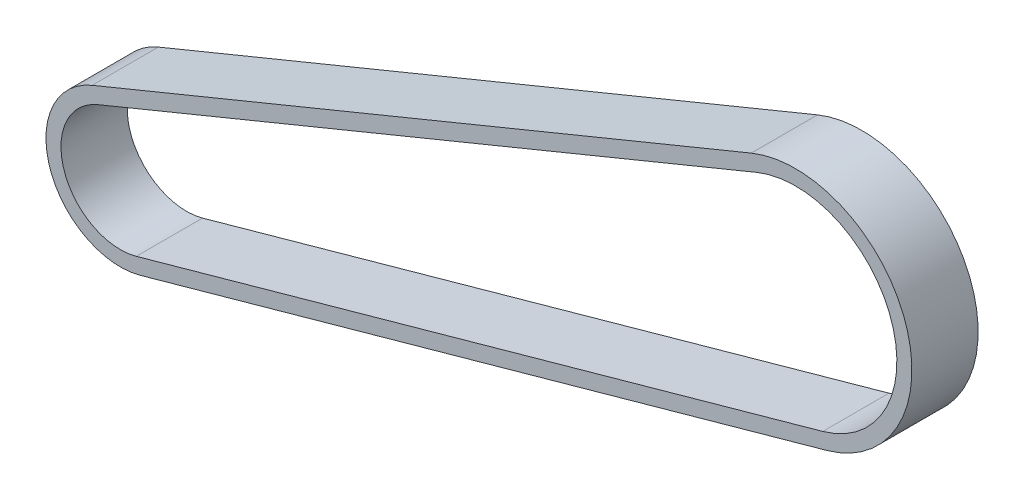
ISO-10303-21;
HEADER;
FILE_DESCRIPTION(('STEP AP214'),'2;1');
FILE_NAME('part.step','',(''),(''),'','','');
FILE_SCHEMA(('AUTOMOTIVE_DESIGN { 1 0 10303 214 1 1 1 1 }'));
ENDSEC;
DATA;
#1=APPLICATION_CONTEXT('core data for automotive mechanical design processes');
#2=APPLICATION_PROTOCOL_DEFINITION('international standard','automotive_design',2000,#1);
#3=PRODUCT_CONTEXT('',#1,'mechanical');
#4=PRODUCT('Part','Part','',(#3));
#5=PRODUCT_RELATED_PRODUCT_CATEGORY('part','',(#4));
#6=PRODUCT_DEFINITION_FORMATION('','',#4);
#7=PRODUCT_DEFINITION_CONTEXT('part definition',#1,'design');
#8=PRODUCT_DEFINITION('design','',#6,#7);
#9=PRODUCT_DEFINITION_SHAPE('','',#8);
#10=(LENGTH_UNIT() NAMED_UNIT(*) SI_UNIT(.MILLI.,.METRE.));
#11=(NAMED_UNIT(*) PLANE_ANGLE_UNIT() SI_UNIT($,.RADIAN.));
#12=(NAMED_UNIT(*) SI_UNIT($,.STERADIAN.) SOLID_ANGLE_UNIT());
#13=UNCERTAINTY_MEASURE_WITH_UNIT(LENGTH_MEASURE(1.E-05),#10,'distance_accuracy_value','');
#14=(GEOMETRIC_REPRESENTATION_CONTEXT(3) GLOBAL_UNCERTAINTY_ASSIGNED_CONTEXT((#13)) GLOBAL_UNIT_ASSIGNED_CONTEXT((#10,
#11,#12)) REPRESENTATION_CONTEXT('',''));
#15=CARTESIAN_POINT('',(0.,0.,0.));
#16=DIRECTION('',(0.,0.,1.));
#17=DIRECTION('',(1.,0.,0.));
#18=AXIS2_PLACEMENT_3D('',#15,#16,#17);
#19=CARTESIAN_POINT('',(-61.1500000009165,-21.0166615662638,3.));
#20=DIRECTION('',(0.,0.,1.));
#21=DIRECTION('',(1.00000000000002,0.,0.));
#22=AXIS2_PLACEMENT_3D('',#19,#20,#21);
#23=PLANE('',#22);
#24=CARTESIAN_POINT('',(-61.1500000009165,-21.0166615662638,3.));
#25=DIRECTION('',(0.,0.,1.));
#26=DIRECTION('',(1.00000000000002,0.,0.));
#27=AXIS2_PLACEMENT_3D('',#24,#25,#26);
#28=CIRCLE('',#27,6.73747048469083);
#29=CARTESIAN_POINT('',(-63.710881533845,-14.7848565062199,3.));
#30=VERTEX_POINT('',#29);
#31=CARTESIAN_POINT('',(-59.338715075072,-27.5060957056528,3.));
#32=VERTEX_POINT('',#31);
#33=EDGE_CURVE('E133',#30,#32,#28,.T.);
#34=ORIENTED_EDGE('',*,*,#33,.T.);
#35=DIRECTION('',(0.963185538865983,0.268837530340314,0.));
#36=VECTOR('',#35,1.);
#37=CARTESIAN_POINT('',(-59.338715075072,-27.5060957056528,3.));
#38=LINE('',#37,#36);
#39=CARTESIAN_POINT('',(2.83381640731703,-10.1529387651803,3.));
#40=VERTEX_POINT('',#39);
#41=EDGE_CURVE('E136',#32,#40,#38,.T.);
#42=ORIENTED_EDGE('',*,*,#41,.T.);
#43=CARTESIAN_POINT('',(0.,0.,3.));
#44=DIRECTION('',(0.,0.,1.));
#45=DIRECTION('',(1.00000000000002,0.,0.));
#46=AXIS2_PLACEMENT_3D('',#43,#44,#45);
#47=CIRCLE('',#46,10.541);
#48=CARTESIAN_POINT('',(-4.00658560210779,9.74986937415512,3.));
#49=VERTEX_POINT('',#48);
#50=EDGE_CURVE('E139',#40,#49,#47,.T.);
#51=ORIENTED_EDGE('',*,*,#50,.T.);
#52=DIRECTION('',(-0.924947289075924,-0.380095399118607,0.));
#53=VECTOR('',#52,1.);
#54=CARTESIAN_POINT('',(-63.710881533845,-14.7848565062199,3.));
#55=LINE('',#54,#53);
#56=EDGE_CURVE('E141',#49,#30,#55,.T.);
#57=ORIENTED_EDGE('',*,*,#56,.T.);
#58=EDGE_LOOP('',(#34,#42,#51,#57));
#59=FACE_BOUND('',#58,.T.);
#60=DIRECTION('',(0.963185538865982,0.268837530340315,0.));
#61=VECTOR('',#60,1.);
#62=CARTESIAN_POINT('',(-59.7043341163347,-26.1961633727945,3.));
#63=LINE('',#62,#61);
#64=CARTESIAN_POINT('',(-59.7043341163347,-26.1961633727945,3.));
#65=VERTEX_POINT('',#64);
#66=CARTESIAN_POINT('',(2.46819736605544,-8.84300643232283,3.));
#67=VERTEX_POINT('',#66);
#68=EDGE_CURVE('E105',#65,#67,#63,.T.);
#69=ORIENTED_EDGE('',*,*,#68,.F.);
#70=CARTESIAN_POINT('',(-61.1500000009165,-21.0166615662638,3.));
#71=DIRECTION('',(0.,0.,1.));
#72=DIRECTION('',(1.00000000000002,0.,0.));
#73=AXIS2_PLACEMENT_3D('',#70,#71,#72);
#74=CIRCLE('',#73,5.37747048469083);
#75=CARTESIAN_POINT('',(-63.1939517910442,-16.0427848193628,3.));
#76=VERTEX_POINT('',#75);
#77=EDGE_CURVE('E97',#76,#65,#74,.T.);
#78=ORIENTED_EDGE('',*,*,#77,.F.);
#79=DIRECTION('',(-0.924947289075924,-0.380095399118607,0.));
#80=VECTOR('',#79,1.);
#81=CARTESIAN_POINT('',(-63.1939517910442,-16.0427848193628,3.));
#82=LINE('',#81,#80);
#83=CARTESIAN_POINT('',(-3.48965585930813,8.49194106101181,3.));
#84=VERTEX_POINT('',#83);
#85=EDGE_CURVE('E119',#84,#76,#82,.T.);
#86=ORIENTED_EDGE('',*,*,#85,.F.);
#87=CARTESIAN_POINT('',(0.,0.,3.));
#88=DIRECTION('',(0.,0.,1.));
#89=DIRECTION('',(1.00000000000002,0.,0.));
#90=AXIS2_PLACEMENT_3D('',#87,#88,#89);
#91=CIRCLE('',#90,9.181);
#92=EDGE_CURVE('E117',#67,#84,#91,.T.);
#93=ORIENTED_EDGE('',*,*,#92,.F.);
#94=EDGE_LOOP('',(#69,#78,#86,#93));
#95=FACE_BOUND('',#94,.T.);
#96=ADVANCED_FACE('F32',(#59,#95),#23,.T.);
#97=CARTESIAN_POINT('',(-61.1500000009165,-21.0166615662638,-3.));
#98=DIRECTION('',(0.,0.,1.));
#99=DIRECTION('',(1.00000000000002,0.,0.));
#100=AXIS2_PLACEMENT_3D('',#97,#98,#99);
#101=PLANE('',#100);
#102=CARTESIAN_POINT('',(-61.1500000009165,-21.0166615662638,-3.));
#103=DIRECTION('',(0.,0.,1.));
#104=DIRECTION('',(1.00000000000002,0.,0.));
#105=AXIS2_PLACEMENT_3D('',#102,#103,#104);
#106=CIRCLE('',#105,6.73747048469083);
#107=CARTESIAN_POINT('',(-63.710881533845,-14.7848565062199,-3.));
#108=VERTEX_POINT('',#107);
#109=CARTESIAN_POINT('',(-59.338715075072,-27.5060957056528,-3.));
#110=VERTEX_POINT('',#109);
#111=EDGE_CURVE('E113',#108,#110,#106,.T.);
#112=ORIENTED_EDGE('',*,*,#111,.F.);
#113=DIRECTION('',(-0.924947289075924,-0.380095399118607,0.));
#114=VECTOR('',#113,1.);
#115=CARTESIAN_POINT('',(-63.710881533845,-14.7848565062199,-3.));
#116=LINE('',#115,#114);
#117=CARTESIAN_POINT('',(-4.00658560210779,9.74986937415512,-3.));
#118=VERTEX_POINT('',#117);
#119=EDGE_CURVE('E137',#118,#108,#116,.T.);
#120=ORIENTED_EDGE('',*,*,#119,.F.);
#121=CARTESIAN_POINT('',(0.,0.,-3.));
#122=DIRECTION('',(0.,0.,1.));
#123=DIRECTION('',(1.00000000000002,0.,0.));
#124=AXIS2_PLACEMENT_3D('',#121,#122,#123);
#125=CIRCLE('',#124,10.541);
#126=CARTESIAN_POINT('',(2.83381640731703,-10.1529387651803,-3.));
#127=VERTEX_POINT('',#126);
#128=EDGE_CURVE('E148',#127,#118,#125,.T.);
#129=ORIENTED_EDGE('',*,*,#128,.F.);
#130=DIRECTION('',(0.963185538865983,0.268837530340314,0.));
#131=VECTOR('',#130,1.);
#132=CARTESIAN_POINT('',(-59.338715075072,-27.5060957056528,-3.));
#133=LINE('',#132,#131);
#134=EDGE_CURVE('E146',#110,#127,#133,.T.);
#135=ORIENTED_EDGE('',*,*,#134,.F.);
#136=EDGE_LOOP('',(#112,#120,#129,#135));
#137=FACE_BOUND('',#136,.T.);
#138=CARTESIAN_POINT('',(-61.1500000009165,-21.0166615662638,-3.));
#139=DIRECTION('',(0.,0.,1.));
#140=DIRECTION('',(1.00000000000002,0.,0.));
#141=AXIS2_PLACEMENT_3D('',#138,#139,#140);
#142=CIRCLE('',#141,5.37747048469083);
#143=CARTESIAN_POINT('',(-63.1939517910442,-16.0427848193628,-3.));
#144=VERTEX_POINT('',#143);
#145=CARTESIAN_POINT('',(-59.7043341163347,-26.1961633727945,-3.));
#146=VERTEX_POINT('',#145);
#147=EDGE_CURVE('E55',#144,#146,#142,.T.);
#148=ORIENTED_EDGE('',*,*,#147,.T.);
#149=DIRECTION('',(0.963185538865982,0.268837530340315,0.));
#150=VECTOR('',#149,1.);
#151=CARTESIAN_POINT('',(-59.7043341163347,-26.1961633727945,-3.));
#152=LINE('',#151,#150);
#153=CARTESIAN_POINT('',(2.46819736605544,-8.84300643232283,-3.));
#154=VERTEX_POINT('',#153);
#155=EDGE_CURVE('E112',#146,#154,#152,.T.);
#156=ORIENTED_EDGE('',*,*,#155,.T.);
#157=CARTESIAN_POINT('',(0.,0.,-3.));
#158=DIRECTION('',(0.,0.,1.));
#159=DIRECTION('',(1.00000000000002,0.,0.));
#160=AXIS2_PLACEMENT_3D('',#157,#158,#159);
#161=CIRCLE('',#160,9.181);
#162=CARTESIAN_POINT('',(-3.48965585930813,8.49194106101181,-3.));
#163=VERTEX_POINT('',#162);
#164=EDGE_CURVE('E125',#154,#163,#161,.T.);
#165=ORIENTED_EDGE('',*,*,#164,.T.);
#166=DIRECTION('',(-0.924947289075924,-0.380095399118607,0.));
#167=VECTOR('',#166,1.);
#168=CARTESIAN_POINT('',(-63.1939517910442,-16.0427848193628,-3.));
#169=LINE('',#168,#167);
#170=EDGE_CURVE('E106',#163,#144,#169,.T.);
#171=ORIENTED_EDGE('',*,*,#170,.T.);
#172=EDGE_LOOP('',(#148,#156,#165,#171));
#173=FACE_BOUND('',#172,.T.);
#174=ADVANCED_FACE('F166',(#137,#173),#101,.F.);
#175=CARTESIAN_POINT('',(-61.1500000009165,-21.0166615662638,3.));
#176=DIRECTION('',(0.,0.,-1.));
#177=DIRECTION('',(-1.00000000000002,0.,0.));
#178=AXIS2_PLACEMENT_3D('',#175,#176,#177);
#179=CYLINDRICAL_SURFACE('',#178,6.73747048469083);
#180=ORIENTED_EDGE('',*,*,#111,.T.);
#181=DIRECTION('',(0.,0.,-1.));
#182=VECTOR('',#181,1.);
#183=CARTESIAN_POINT('',(-59.338715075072,-27.5060957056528,3.));
#184=LINE('',#183,#182);
#185=EDGE_CURVE('E11',#32,#110,#184,.T.);
#186=ORIENTED_EDGE('',*,*,#185,.F.);
#187=ORIENTED_EDGE('',*,*,#33,.F.);
#188=DIRECTION('',(0.,0.,-1.));
#189=VECTOR('',#188,1.);
#190=CARTESIAN_POINT('',(-63.710881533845,-14.7848565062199,3.));
#191=LINE('',#190,#189);
#192=EDGE_CURVE('E143',#30,#108,#191,.T.);
#193=ORIENTED_EDGE('',*,*,#192,.T.);
#194=EDGE_LOOP('',(#180,#186,#187,#193));
#195=FACE_BOUND('',#194,.T.);
#196=ADVANCED_FACE('F34',(#195),#179,.T.);
#197=CARTESIAN_POINT('',(-59.338715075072,-27.5060957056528,3.));
#198=DIRECTION('',(-0.268837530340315,0.963185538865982,0.));
#199=DIRECTION('',(-0.963185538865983,-0.268837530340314,0.));
#200=AXIS2_PLACEMENT_3D('',#197,#198,#199);
#201=PLANE('',#200);
#202=ORIENTED_EDGE('',*,*,#134,.T.);
#203=DIRECTION('',(0.,0.,-1.));
#204=VECTOR('',#203,1.);
#205=CARTESIAN_POINT('',(2.83381640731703,-10.1529387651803,3.));
#206=LINE('',#205,#204);
#207=EDGE_CURVE('E40',#40,#127,#206,.T.);
#208=ORIENTED_EDGE('',*,*,#207,.F.);
#209=ORIENTED_EDGE('',*,*,#41,.F.);
#210=ORIENTED_EDGE('',*,*,#185,.T.);
#211=EDGE_LOOP('',(#202,#208,#209,#210));
#212=FACE_BOUND('',#211,.T.);
#213=ADVANCED_FACE('F176',(#212),#201,.F.);
#214=CARTESIAN_POINT('',(0.,0.,3.));
#215=DIRECTION('',(0.,0.,-1.));
#216=DIRECTION('',(-1.00000000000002,0.,0.));
#217=AXIS2_PLACEMENT_3D('',#214,#215,#216);
#218=CYLINDRICAL_SURFACE('',#217,10.541);
#219=ORIENTED_EDGE('',*,*,#128,.T.);
#220=DIRECTION('',(0.,0.,-1.));
#221=VECTOR('',#220,1.);
#222=CARTESIAN_POINT('',(-4.00658560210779,9.74986937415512,3.));
#223=LINE('',#222,#221);
#224=EDGE_CURVE('E153',#49,#118,#223,.T.);
#225=ORIENTED_EDGE('',*,*,#224,.F.);
#226=ORIENTED_EDGE('',*,*,#50,.F.);
#227=ORIENTED_EDGE('',*,*,#207,.T.);
#228=EDGE_LOOP('',(#219,#225,#226,#227));
#229=FACE_BOUND('',#228,.T.);
#230=ADVANCED_FACE('F160',(#229),#218,.T.);
#231=CARTESIAN_POINT('',(-63.710881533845,-14.7848565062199,3.));
#232=DIRECTION('',(0.380095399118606,-0.924947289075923,0.));
#233=DIRECTION('',(0.924947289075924,0.380095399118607,0.));
#234=AXIS2_PLACEMENT_3D('',#231,#232,#233);
#235=PLANE('',#234);
#236=ORIENTED_EDGE('',*,*,#119,.T.);
#237=ORIENTED_EDGE('',*,*,#192,.F.);
#238=ORIENTED_EDGE('',*,*,#56,.F.);
#239=ORIENTED_EDGE('',*,*,#224,.T.);
#240=EDGE_LOOP('',(#236,#237,#238,#239));
#241=FACE_BOUND('',#240,.T.);
#242=ADVANCED_FACE('F170',(#241),#235,.F.);
#243=CARTESIAN_POINT('',(-61.1500000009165,-21.0166615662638,3.));
#244=DIRECTION('',(0.,0.,-1.));
#245=DIRECTION('',(-1.00000000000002,0.,0.));
#246=AXIS2_PLACEMENT_3D('',#243,#244,#245);
#247=CYLINDRICAL_SURFACE('',#246,5.37747048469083);
#248=ORIENTED_EDGE('',*,*,#147,.F.);
#249=DIRECTION('',(0.,0.,-1.));
#250=VECTOR('',#249,1.);
#251=CARTESIAN_POINT('',(-63.1939517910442,-16.0427848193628,3.));
#252=LINE('',#251,#250);
#253=EDGE_CURVE('E101',#76,#144,#252,.T.);
#254=ORIENTED_EDGE('',*,*,#253,.F.);
#255=ORIENTED_EDGE('',*,*,#77,.T.);
#256=DIRECTION('',(0.,0.,-1.));
#257=VECTOR('',#256,1.);
#258=CARTESIAN_POINT('',(-59.7043341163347,-26.1961633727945,3.));
#259=LINE('',#258,#257);
#260=EDGE_CURVE('E100',#65,#146,#259,.T.);
#261=ORIENTED_EDGE('',*,*,#260,.T.);
#262=EDGE_LOOP('',(#248,#254,#255,#261));
#263=FACE_BOUND('',#262,.T.);
#264=ADVANCED_FACE('F99',(#263),#247,.F.);
#265=CARTESIAN_POINT('',(-59.7043341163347,-26.1961633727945,3.));
#266=DIRECTION('',(-0.268837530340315,0.963185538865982,0.));
#267=DIRECTION('',(-0.963185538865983,-0.268837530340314,0.));
#268=AXIS2_PLACEMENT_3D('',#265,#266,#267);
#269=PLANE('',#268);
#270=ORIENTED_EDGE('',*,*,#155,.F.);
#271=ORIENTED_EDGE('',*,*,#260,.F.);
#272=ORIENTED_EDGE('',*,*,#68,.T.);
#273=DIRECTION('',(0.,0.,-1.));
#274=VECTOR('',#273,1.);
#275=CARTESIAN_POINT('',(2.46819736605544,-8.84300643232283,3.));
#276=LINE('',#275,#274);
#277=EDGE_CURVE('E114',#67,#154,#276,.T.);
#278=ORIENTED_EDGE('',*,*,#277,.T.);
#279=EDGE_LOOP('',(#270,#271,#272,#278));
#280=FACE_BOUND('',#279,.T.);
#281=ADVANCED_FACE('F109',(#280),#269,.T.);
#282=CARTESIAN_POINT('',(0.,0.,3.));
#283=DIRECTION('',(0.,0.,-1.));
#284=DIRECTION('',(-1.00000000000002,0.,0.));
#285=AXIS2_PLACEMENT_3D('',#282,#283,#284);
#286=CYLINDRICAL_SURFACE('',#285,9.181);
#287=ORIENTED_EDGE('',*,*,#164,.F.);
#288=ORIENTED_EDGE('',*,*,#277,.F.);
#289=ORIENTED_EDGE('',*,*,#92,.T.);
#290=DIRECTION('',(0.,0.,-1.));
#291=VECTOR('',#290,1.);
#292=CARTESIAN_POINT('',(-3.48965585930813,8.49194106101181,3.));
#293=LINE('',#292,#291);
#294=EDGE_CURVE('E47',#84,#163,#293,.T.);
#295=ORIENTED_EDGE('',*,*,#294,.T.);
#296=EDGE_LOOP('',(#287,#288,#289,#295));
#297=FACE_BOUND('',#296,.T.);
#298=ADVANCED_FACE('F199',(#297),#286,.F.);
#299=CARTESIAN_POINT('',(-63.1939517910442,-16.0427848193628,3.));
#300=DIRECTION('',(0.380095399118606,-0.924947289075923,0.));
#301=DIRECTION('',(0.924947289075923,0.380095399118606,0.));
#302=AXIS2_PLACEMENT_3D('',#299,#300,#301);
#303=PLANE('',#302);
#304=ORIENTED_EDGE('',*,*,#170,.F.);
#305=ORIENTED_EDGE('',*,*,#294,.F.);
#306=ORIENTED_EDGE('',*,*,#85,.T.);
#307=ORIENTED_EDGE('',*,*,#253,.T.);
#308=EDGE_LOOP('',(#304,#305,#306,#307));
#309=FACE_BOUND('',#308,.T.);
#310=ADVANCED_FACE('F203',(#309),#303,.T.);
#311=CLOSED_SHELL('',(#96,#174,#196,#213,#230,#242,#264,#281,#298,#310));
#312=MANIFOLD_SOLID_BREP('B2',#311);
#313=ADVANCED_BREP_SHAPE_REPRESENTATION('',(#18,#312),#14);
#314=SHAPE_DEFINITION_REPRESENTATION(#9,#313);
ENDSEC;
END-ISO-10303-21;
